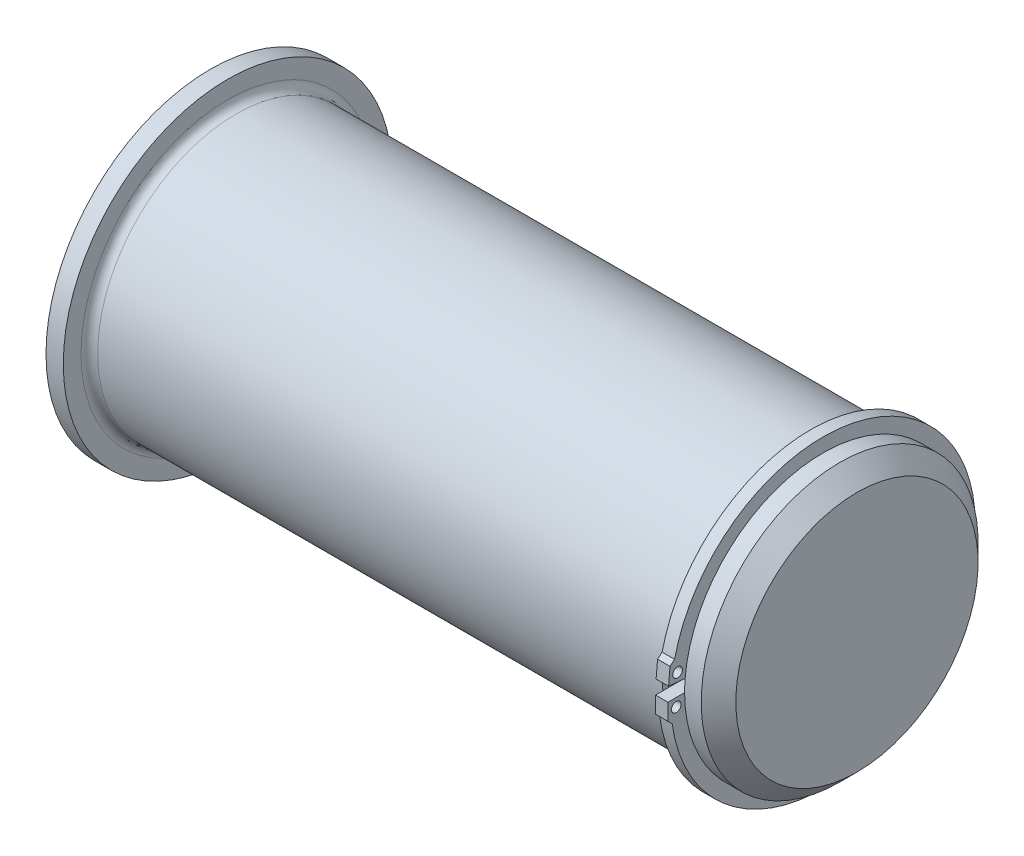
from build123d import *

# Parameters (mm, degrees)
BOSS_EXTRUDE1_START = 1.143
SKETCH5_R           = 0.4445
BOSS_EXTRUDE1_DEPTH = 1.143


with BuildPart() as part:
    # Sketch3 → Revolve1 (revolve)
    with BuildSketch(Plane.XY, mode=Mode.PRIVATE) as revolve1_sk:
        with BuildLine():
            Line((0, 0), (55.9435, 0))
            Line((55.9435, 0), (55.9435, 11.1125))
            Line((55.9435, 11.1125), (54.356, 12.7))
            Line((54.356, 12.7), (52.832, 12.7))
            Line((52.832, 12.7), (52.832, 11.049))
            Line((52.832, 11.049), (50.8, 11.049))
            Line((50.8, 11.049), (50.8, 12.7))
            Line((50.8, 12.7), (0, 12.7))
            Line((0, 12.7), (-1.016, 12.7))
            ThreePointArc((-1.016, 12.7), (-1.554815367, 12.923184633), (-1.778, 13.462))
            Line((-1.778, 13.462), (-1.778, 15.0876))
            Line((-1.778, 15.0876), (-3.3655, 15.0876))
            Line((-3.3655, 15.0876), (-3.3655, 0))
            Line((-3.3655, 0), (0, 0))
        make_face()
    revolve(revolve1_sk.sketch.rotate(Axis((0, 0, 0), (1, 0, 0)), 180), axis=Axis((0, 0, 0), (1, 0, 0)))

    # Sketch5 → Boss-Extrude1 (add)
    with BuildSketch(Plane.ZY.offset(-52.832).offset(BOSS_EXTRUDE1_START)):
        with BuildLine():
            Line((11.006955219, 0.962983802), (14.169873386, 1.239703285))
            Line((14.169873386, 1.239703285), (14.037048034, 2.757904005))
            Line((14.037048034, 2.757904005), (13.619898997, 3.107933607))
            ThreePointArc((13.619898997, 3.107933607), (-13.956703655, -0.609362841), (13.838945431, -1.909054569))
            Line((13.838945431, -1.909054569), (14.224, -1.524))
            Line((14.224, -1.524), (14.224, 0))
            Line((14.224, 0), (11.049, 0))
            ThreePointArc((11.049, 0), (-11.0384838, -0.481950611), (11.006955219, 0.962983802))
        make_face()
        with Locations((13.34436035, 1.932390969)):
            Circle(SKETCH5_R, mode=Mode.SUBTRACT)
        with Locations((13.462, -0.762)):
            Circle(SKETCH5_R, mode=Mode.SUBTRACT)
    extrude(amount=-BOSS_EXTRUDE1_DEPTH)


solid = part.part
